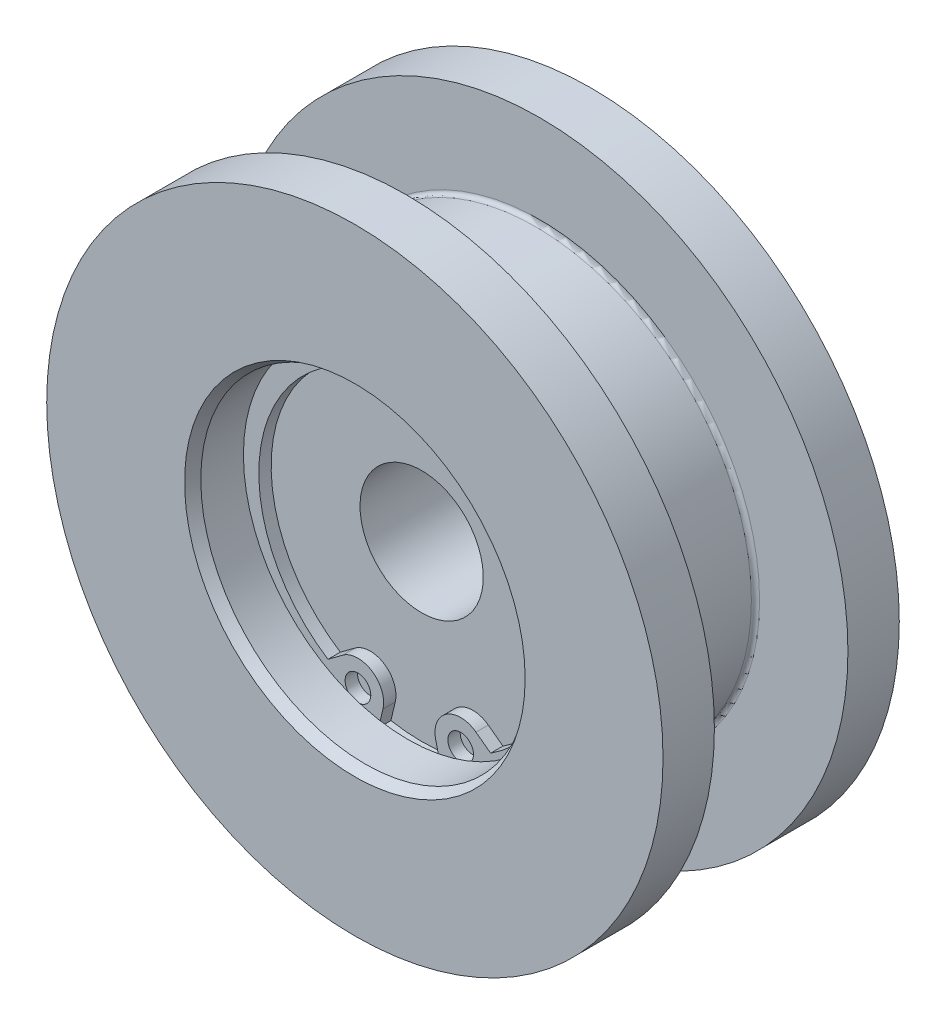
ISO-10303-21;
HEADER;
FILE_DESCRIPTION(('STEP AP214'),'2;1');
FILE_NAME('part.step','',(''),(''),'','','');
FILE_SCHEMA(('AUTOMOTIVE_DESIGN { 1 0 10303 214 1 1 1 1 }'));
ENDSEC;
DATA;
#1=APPLICATION_CONTEXT('core data for automotive mechanical design processes');
#2=APPLICATION_PROTOCOL_DEFINITION('international standard','automotive_design',2000,#1);
#3=PRODUCT_CONTEXT('',#1,'mechanical');
#4=PRODUCT('Part','Part','',(#3));
#5=PRODUCT_RELATED_PRODUCT_CATEGORY('part','',(#4));
#6=PRODUCT_DEFINITION_FORMATION('','',#4);
#7=PRODUCT_DEFINITION_CONTEXT('part definition',#1,'design');
#8=PRODUCT_DEFINITION('design','',#6,#7);
#9=PRODUCT_DEFINITION_SHAPE('','',#8);
#10=(LENGTH_UNIT() NAMED_UNIT(*) SI_UNIT(.MILLI.,.METRE.));
#11=(NAMED_UNIT(*) PLANE_ANGLE_UNIT() SI_UNIT($,.RADIAN.));
#12=(NAMED_UNIT(*) SI_UNIT($,.STERADIAN.) SOLID_ANGLE_UNIT());
#13=UNCERTAINTY_MEASURE_WITH_UNIT(LENGTH_MEASURE(1.E-05),#10,'distance_accuracy_value','');
#14=(GEOMETRIC_REPRESENTATION_CONTEXT(3) GLOBAL_UNCERTAINTY_ASSIGNED_CONTEXT((#13)) GLOBAL_UNIT_ASSIGNED_CONTEXT((#10,
#11,#12)) REPRESENTATION_CONTEXT('',''));
#15=CARTESIAN_POINT('',(0.,0.,0.));
#16=DIRECTION('',(0.,0.,1.));
#17=DIRECTION('',(1.,0.,0.));
#18=AXIS2_PLACEMENT_3D('',#15,#16,#17);
#19=CARTESIAN_POINT('',(17.0522,-17.110876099,5.));
#20=DIRECTION('',(0.,0.,-1.));
#21=DIRECTION('',(-1.,0.,0.));
#22=AXIS2_PLACEMENT_3D('',#19,#20,#21);
#23=PLANE('',#22);
#24=CARTESIAN_POINT('',(5.,-14.2233767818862,5.));
#25=DIRECTION('',(0.,0.,1.));
#26=DIRECTION('',(1.,0.,0.));
#27=AXIS2_PLACEMENT_3D('',#24,#25,#26);
#28=CIRCLE('',#27,1.25);
#29=CARTESIAN_POINT('',(6.25,-14.2233767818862,5.));
#30=VERTEX_POINT('',#29);
#31=EDGE_CURVE('E117',#30,#30,#28,.T.);
#32=ORIENTED_EDGE('',*,*,#31,.T.);
#33=EDGE_LOOP('',(#32));
#34=FACE_BOUND('',#33,.T.);
#35=ADVANCED_FACE('F14',(#34),#23,.F.);
#36=CARTESIAN_POINT('',(-5.,-14.2233767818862,5.));
#37=DIRECTION('',(0.,0.,-1.));
#38=DIRECTION('',(1.,0.,0.));
#39=AXIS2_PLACEMENT_3D('',#36,#37,#38);
#40=CIRCLE('',#39,1.25);
#41=CARTESIAN_POINT('',(-3.75,-14.2233767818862,5.));
#42=VERTEX_POINT('',#41);
#43=EDGE_CURVE('E143',#42,#42,#40,.T.);
#44=ORIENTED_EDGE('',*,*,#43,.F.);
#45=EDGE_LOOP('',(#44));
#46=FACE_BOUND('',#45,.T.);
#47=ADVANCED_FACE('F251',(#46),#23,.F.);
#48=CARTESIAN_POINT('',(0.,0.,-6.1));
#49=DIRECTION('',(0.,0.,1.));
#50=DIRECTION('',(1.,0.,0.));
#51=AXIS2_PLACEMENT_3D('',#48,#49,#50);
#52=CYLINDRICAL_SURFACE('',#51,21.);
#53=CARTESIAN_POINT('',(0.,0.,6.1));
#54=DIRECTION('',(0.,0.,-1.));
#55=DIRECTION('',(-1.,0.,0.));
#56=AXIS2_PLACEMENT_3D('',#53,#54,#55);
#57=CIRCLE('',#56,21.);
#58=CARTESIAN_POINT('',(-21.,0.,6.1));
#59=VERTEX_POINT('',#58);
#60=EDGE_CURVE('E183',#59,#59,#57,.T.);
#61=ORIENTED_EDGE('',*,*,#60,.T.);
#62=EDGE_LOOP('',(#61));
#63=FACE_BOUND('',#62,.T.);
#64=CARTESIAN_POINT('',(0.,0.,-6.1));
#65=DIRECTION('',(0.,0.,1.));
#66=DIRECTION('',(1.,0.,0.));
#67=AXIS2_PLACEMENT_3D('',#64,#65,#66);
#68=CIRCLE('',#67,21.);
#69=CARTESIAN_POINT('',(21.,0.,-6.1));
#70=VERTEX_POINT('',#69);
#71=EDGE_CURVE('E187',#70,#70,#68,.T.);
#72=ORIENTED_EDGE('',*,*,#71,.T.);
#73=EDGE_LOOP('',(#72));
#74=FACE_BOUND('',#73,.T.);
#75=ADVANCED_FACE('F259',(#63,#74),#52,.T.);
#76=CARTESIAN_POINT('',(0.,0.,6.1));
#77=DIRECTION('',(0.,0.,1.));
#78=DIRECTION('',(1.,0.,0.));
#79=AXIS2_PLACEMENT_3D('',#76,#77,#78);
#80=TOROIDAL_SURFACE('',#79,21.4,0.4);
#81=CARTESIAN_POINT('',(0.,0.,6.5));
#82=DIRECTION('',(0.,0.,1.));
#83=DIRECTION('',(1.,0.,0.));
#84=AXIS2_PLACEMENT_3D('',#81,#82,#83);
#85=CIRCLE('',#84,21.40000002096);
#86=CARTESIAN_POINT('',(21.40000002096,0.,6.5));
#87=VERTEX_POINT('',#86);
#88=EDGE_CURVE('E182',#87,#87,#85,.F.);
#89=ORIENTED_EDGE('',*,*,#88,.T.);
#90=EDGE_LOOP('',(#89));
#91=FACE_BOUND('',#90,.T.);
#92=ORIENTED_EDGE('',*,*,#60,.F.);
#93=EDGE_LOOP('',(#92));
#94=FACE_BOUND('',#93,.T.);
#95=ADVANCED_FACE('F299',(#91,#94),#80,.F.);
#96=CARTESIAN_POINT('',(0.,0.,-6.1));
#97=DIRECTION('',(0.,0.,1.));
#98=DIRECTION('',(1.,0.,0.));
#99=AXIS2_PLACEMENT_3D('',#96,#97,#98);
#100=TOROIDAL_SURFACE('',#99,21.4,0.4);
#101=ORIENTED_EDGE('',*,*,#71,.F.);
#102=EDGE_LOOP('',(#101));
#103=FACE_BOUND('',#102,.T.);
#104=CARTESIAN_POINT('',(0.,0.,-6.5));
#105=DIRECTION('',(0.,0.,1.));
#106=DIRECTION('',(1.,0.,0.));
#107=AXIS2_PLACEMENT_3D('',#104,#105,#106);
#108=CIRCLE('',#107,21.4);
#109=CARTESIAN_POINT('',(21.4,0.,-6.5));
#110=VERTEX_POINT('',#109);
#111=EDGE_CURVE('E205',#110,#110,#108,.F.);
#112=ORIENTED_EDGE('',*,*,#111,.F.);
#113=EDGE_LOOP('',(#112));
#114=FACE_BOUND('',#113,.T.);
#115=ADVANCED_FACE('F318',(#103,#114),#100,.F.);
#116=CARTESIAN_POINT('',(-30.36,-30.464467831,6.5));
#117=DIRECTION('',(0.,0.,1.));
#118=DIRECTION('',(1.,0.,0.));
#119=AXIS2_PLACEMENT_3D('',#116,#117,#118);
#120=PLANE('',#119);
#121=ORIENTED_EDGE('',*,*,#88,.F.);
#122=EDGE_LOOP('',(#121));
#123=FACE_BOUND('',#122,.T.);
#124=CARTESIAN_POINT('',(0.,0.,6.5));
#125=DIRECTION('',(0.,0.,1.));
#126=DIRECTION('',(1.,0.,0.));
#127=AXIS2_PLACEMENT_3D('',#124,#125,#126);
#128=CIRCLE('',#127,30.);
#129=CARTESIAN_POINT('',(30.,0.,6.5));
#130=VERTEX_POINT('',#129);
#131=EDGE_CURVE('E193',#130,#130,#128,.T.);
#132=ORIENTED_EDGE('',*,*,#131,.F.);
#133=EDGE_LOOP('',(#132));
#134=FACE_BOUND('',#133,.T.);
#135=ADVANCED_FACE('F311',(#123,#134),#120,.F.);
#136=CARTESIAN_POINT('',(30.36,-30.464467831,-6.5));
#137=DIRECTION('',(0.,0.,-1.));
#138=DIRECTION('',(-1.,0.,0.));
#139=AXIS2_PLACEMENT_3D('',#136,#137,#138);
#140=PLANE('',#139);
#141=ORIENTED_EDGE('',*,*,#111,.T.);
#142=EDGE_LOOP('',(#141));
#143=FACE_BOUND('',#142,.T.);
#144=CARTESIAN_POINT('',(0.,0.,-6.5));
#145=DIRECTION('',(0.,0.,1.));
#146=DIRECTION('',(1.,0.,0.));
#147=AXIS2_PLACEMENT_3D('',#144,#145,#146);
#148=CIRCLE('',#147,30.);
#149=CARTESIAN_POINT('',(30.,0.,-6.5));
#150=VERTEX_POINT('',#149);
#151=EDGE_CURVE('E211',#150,#150,#148,.F.);
#152=ORIENTED_EDGE('',*,*,#151,.F.);
#153=EDGE_LOOP('',(#152));
#154=FACE_BOUND('',#153,.T.);
#155=ADVANCED_FACE('F306',(#143,#154),#140,.F.);
#156=CARTESIAN_POINT('',(0.,0.,6.5));
#157=DIRECTION('',(0.,0.,1.));
#158=DIRECTION('',(1.,0.,0.));
#159=AXIS2_PLACEMENT_3D('',#156,#157,#158);
#160=CYLINDRICAL_SURFACE('',#159,30.);
#161=CARTESIAN_POINT('',(0.,0.,11.5));
#162=DIRECTION('',(0.,0.,1.));
#163=DIRECTION('',(1.,0.,0.));
#164=AXIS2_PLACEMENT_3D('',#161,#162,#163);
#165=CIRCLE('',#164,30.);
#166=CARTESIAN_POINT('',(30.,0.,11.5));
#167=VERTEX_POINT('',#166);
#168=EDGE_CURVE('E144',#167,#167,#165,.F.);
#169=ORIENTED_EDGE('',*,*,#168,.T.);
#170=EDGE_LOOP('',(#169));
#171=FACE_BOUND('',#170,.T.);
#172=ORIENTED_EDGE('',*,*,#131,.T.);
#173=EDGE_LOOP('',(#172));
#174=FACE_BOUND('',#173,.T.);
#175=ADVANCED_FACE('F293',(#171,#174),#160,.T.);
#176=CARTESIAN_POINT('',(0.,0.,-11.5));
#177=DIRECTION('',(0.,0.,1.));
#178=DIRECTION('',(1.,0.,0.));
#179=AXIS2_PLACEMENT_3D('',#176,#177,#178);
#180=CYLINDRICAL_SURFACE('',#179,30.);
#181=ORIENTED_EDGE('',*,*,#151,.T.);
#182=EDGE_LOOP('',(#181));
#183=FACE_BOUND('',#182,.T.);
#184=CARTESIAN_POINT('',(0.,0.,-11.5));
#185=DIRECTION('',(0.,0.,1.));
#186=DIRECTION('',(1.,0.,0.));
#187=AXIS2_PLACEMENT_3D('',#184,#185,#186);
#188=CIRCLE('',#187,30.);
#189=CARTESIAN_POINT('',(30.,0.,-11.5));
#190=VERTEX_POINT('',#189);
#191=EDGE_CURVE('E217',#190,#190,#188,.T.);
#192=ORIENTED_EDGE('',*,*,#191,.T.);
#193=EDGE_LOOP('',(#192));
#194=FACE_BOUND('',#193,.T.);
#195=ADVANCED_FACE('F290',(#183,#194),#180,.T.);
#196=CARTESIAN_POINT('',(30.36,-30.464467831,11.5));
#197=DIRECTION('',(0.,0.,-1.));
#198=DIRECTION('',(-1.,0.,0.));
#199=AXIS2_PLACEMENT_3D('',#196,#197,#198);
#200=PLANE('',#199);
#201=CARTESIAN_POINT('',(0.,0.,11.5));
#202=DIRECTION('',(0.,0.,1.));
#203=DIRECTION('',(1.,0.,0.));
#204=AXIS2_PLACEMENT_3D('',#201,#202,#203);
#205=CIRCLE('',#204,16.577350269);
#206=CARTESIAN_POINT('',(16.577350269,0.,11.5));
#207=VERTEX_POINT('',#206);
#208=EDGE_CURVE('E196',#207,#207,#205,.T.);
#209=ORIENTED_EDGE('',*,*,#208,.F.);
#210=EDGE_LOOP('',(#209));
#211=FACE_BOUND('',#210,.T.);
#212=ORIENTED_EDGE('',*,*,#168,.F.);
#213=EDGE_LOOP('',(#212));
#214=FACE_BOUND('',#213,.T.);
#215=ADVANCED_FACE('F16',(#211,#214),#200,.F.);
#216=CARTESIAN_POINT('',(-30.36,-30.464467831,-11.5));
#217=DIRECTION('',(0.,0.,1.));
#218=DIRECTION('',(1.,0.,0.));
#219=AXIS2_PLACEMENT_3D('',#216,#217,#218);
#220=PLANE('',#219);
#221=CARTESIAN_POINT('',(0.,0.,-11.5));
#222=DIRECTION('',(0.,0.,1.));
#223=DIRECTION('',(1.,0.,0.));
#224=AXIS2_PLACEMENT_3D('',#221,#222,#223);
#225=CIRCLE('',#224,13.);
#226=CARTESIAN_POINT('',(13.,0.,-11.5));
#227=VERTEX_POINT('',#226);
#228=EDGE_CURVE('E223',#227,#227,#225,.F.);
#229=ORIENTED_EDGE('',*,*,#228,.F.);
#230=EDGE_LOOP('',(#229));
#231=FACE_BOUND('',#230,.T.);
#232=ORIENTED_EDGE('',*,*,#191,.F.);
#233=EDGE_LOOP('',(#232));
#234=FACE_BOUND('',#233,.T.);
#235=ADVANCED_FACE('F303',(#231,#234),#220,.F.);
#236=CARTESIAN_POINT('',(0.,0.,10.5));
#237=DIRECTION('',(0.,0.,1.));
#238=DIRECTION('',(1.,0.,0.));
#239=AXIS2_PLACEMENT_3D('',#236,#237,#238);
#240=CONICAL_SURFACE('',#239,16.,0.523598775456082);
#241=CARTESIAN_POINT('',(0.,0.,10.5));
#242=DIRECTION('',(0.,0.,1.));
#243=DIRECTION('',(1.,0.,0.));
#244=AXIS2_PLACEMENT_3D('',#241,#242,#243);
#245=CIRCLE('',#244,16.);
#246=CARTESIAN_POINT('',(16.,0.,10.5));
#247=VERTEX_POINT('',#246);
#248=EDGE_CURVE('E179',#247,#247,#245,.T.);
#249=ORIENTED_EDGE('',*,*,#248,.F.);
#250=EDGE_LOOP('',(#249));
#251=FACE_BOUND('',#250,.T.);
#252=ORIENTED_EDGE('',*,*,#208,.T.);
#253=EDGE_LOOP('',(#252));
#254=FACE_BOUND('',#253,.T.);
#255=ADVANCED_FACE('F285',(#251,#254),#240,.F.);
#256=CARTESIAN_POINT('',(0.,0.,-11.5));
#257=DIRECTION('',(0.,0.,1.));
#258=DIRECTION('',(1.,0.,0.));
#259=AXIS2_PLACEMENT_3D('',#256,#257,#258);
#260=CYLINDRICAL_SURFACE('',#259,13.);
#261=ORIENTED_EDGE('',*,*,#228,.T.);
#262=EDGE_LOOP('',(#261));
#263=FACE_BOUND('',#262,.T.);
#264=CARTESIAN_POINT('',(0.,0.,-5.));
#265=DIRECTION('',(0.,0.,1.));
#266=DIRECTION('',(1.,0.,0.));
#267=AXIS2_PLACEMENT_3D('',#264,#265,#266);
#268=CIRCLE('',#267,13.);
#269=CARTESIAN_POINT('',(13.,0.,-5.));
#270=VERTEX_POINT('',#269);
#271=EDGE_CURVE('E226',#270,#270,#268,.T.);
#272=ORIENTED_EDGE('',*,*,#271,.T.);
#273=EDGE_LOOP('',(#272));
#274=FACE_BOUND('',#273,.T.);
#275=ADVANCED_FACE('F230',(#263,#274),#260,.F.);
#276=CARTESIAN_POINT('',(0.,0.,6.35));
#277=DIRECTION('',(0.,0.,1.));
#278=DIRECTION('',(1.,0.,0.));
#279=AXIS2_PLACEMENT_3D('',#276,#277,#278);
#280=CYLINDRICAL_SURFACE('',#279,16.);
#281=CARTESIAN_POINT('',(0.,0.,6.35));
#282=DIRECTION('',(0.,0.,1.));
#283=DIRECTION('',(1.,0.,0.));
#284=AXIS2_PLACEMENT_3D('',#281,#282,#283);
#285=CIRCLE('',#284,16.);
#286=CARTESIAN_POINT('',(16.,0.,6.35));
#287=VERTEX_POINT('',#286);
#288=EDGE_CURVE('E186',#287,#287,#285,.T.);
#289=ORIENTED_EDGE('',*,*,#288,.F.);
#290=EDGE_LOOP('',(#289));
#291=FACE_BOUND('',#290,.T.);
#292=ORIENTED_EDGE('',*,*,#248,.T.);
#293=EDGE_LOOP('',(#292));
#294=FACE_BOUND('',#293,.T.);
#295=ADVANCED_FACE('F235',(#291,#294),#280,.F.);
#296=CARTESIAN_POINT('',(-13.156,-13.201269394,-5.));
#297=DIRECTION('',(0.,0.,1.));
#298=DIRECTION('',(1.,0.,0.));
#299=AXIS2_PLACEMENT_3D('',#296,#297,#298);
#300=PLANE('',#299);
#301=CARTESIAN_POINT('',(0.,0.,-5.));
#302=DIRECTION('',(0.,0.,1.));
#303=DIRECTION('',(0.,-1.,0.));
#304=AXIS2_PLACEMENT_3D('',#301,#302,#303);
#305=CIRCLE('',#304,6.);
#306=CARTESIAN_POINT('',(0.,-6.,-5.));
#307=VERTEX_POINT('',#306);
#308=EDGE_CURVE('E220',#307,#307,#305,.T.);
#309=ORIENTED_EDGE('',*,*,#308,.T.);
#310=EDGE_LOOP('',(#309));
#311=FACE_BOUND('',#310,.T.);
#312=ORIENTED_EDGE('',*,*,#271,.F.);
#313=EDGE_LOOP('',(#312));
#314=FACE_BOUND('',#313,.T.);
#315=ADVANCED_FACE('F232',(#311,#314),#300,.F.);
#316=CARTESIAN_POINT('',(-17.0522,-17.110876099,6.35));
#317=DIRECTION('',(0.,0.,1.));
#318=DIRECTION('',(1.,0.,0.));
#319=AXIS2_PLACEMENT_3D('',#316,#317,#318);
#320=PLANE('',#319);
#321=ORIENTED_EDGE('',*,*,#288,.T.);
#322=EDGE_LOOP('',(#321));
#323=FACE_BOUND('',#322,.T.);
#324=CARTESIAN_POINT('',(0.,0.,6.35));
#325=DIRECTION('',(0.,0.,1.));
#326=DIRECTION('',(1.,0.,0.));
#327=AXIS2_PLACEMENT_3D('',#324,#325,#326);
#328=CIRCLE('',#327,16.85);
#329=CARTESIAN_POINT('',(16.85,0.,6.35));
#330=VERTEX_POINT('',#329);
#331=EDGE_CURVE('E190',#330,#330,#328,.T.);
#332=ORIENTED_EDGE('',*,*,#331,.F.);
#333=EDGE_LOOP('',(#332));
#334=FACE_BOUND('',#333,.T.);
#335=ADVANCED_FACE('F234',(#323,#334),#320,.F.);
#336=CARTESIAN_POINT('',(0.,0.,5.));
#337=DIRECTION('',(0.,0.,1.));
#338=DIRECTION('',(1.,0.,0.));
#339=AXIS2_PLACEMENT_3D('',#336,#337,#338);
#340=CYLINDRICAL_SURFACE('',#339,16.85);
#341=ORIENTED_EDGE('',*,*,#331,.T.);
#342=EDGE_LOOP('',(#341));
#343=FACE_BOUND('',#342,.T.);
#344=DIRECTION('',(0.,0.,1.));
#345=VECTOR('',#344,1.);
#346=CARTESIAN_POINT('',(2.99125499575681,-16.5823669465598,5.));
#347=LINE('',#346,#345);
#348=CARTESIAN_POINT('',(2.99125499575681,-16.5823669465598,5.));
#349=VERTEX_POINT('',#348);
#350=CARTESIAN_POINT('',(2.99125499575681,-16.5823669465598,6.2));
#351=VERTEX_POINT('',#350);
#352=EDGE_CURVE('E18',#349,#351,#347,.T.);
#353=ORIENTED_EDGE('',*,*,#352,.F.);
#354=CARTESIAN_POINT('',(0.,0.,5.));
#355=DIRECTION('',(0.,0.,1.));
#356=DIRECTION('',(1.,0.,0.));
#357=AXIS2_PLACEMENT_3D('',#354,#355,#356);
#358=CIRCLE('',#357,16.85);
#359=CARTESIAN_POINT('',(-2.99125499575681,-16.5823669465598,5.));
#360=VERTEX_POINT('',#359);
#361=EDGE_CURVE('E208',#360,#349,#358,.T.);
#362=ORIENTED_EDGE('',*,*,#361,.F.);
#363=DIRECTION('',(0.,0.,1.));
#364=VECTOR('',#363,1.);
#365=CARTESIAN_POINT('',(-2.99125499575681,-16.5823669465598,5.));
#366=LINE('',#365,#364);
#367=CARTESIAN_POINT('',(-2.99125499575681,-16.5823669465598,6.2));
#368=VERTEX_POINT('',#367);
#369=EDGE_CURVE('E176',#368,#360,#366,.F.);
#370=ORIENTED_EDGE('',*,*,#369,.F.);
#371=CARTESIAN_POINT('',(0.,0.,6.2));
#372=DIRECTION('',(0.,0.,-1.));
#373=DIRECTION('',(-1.,0.,0.));
#374=AXIS2_PLACEMENT_3D('',#371,#372,#373);
#375=CIRCLE('',#374,16.85);
#376=EDGE_CURVE('E9',#351,#368,#375,.F.);
#377=ORIENTED_EDGE('',*,*,#376,.F.);
#378=EDGE_LOOP('',(#353,#362,#370,#377));
#379=FACE_BOUND('',#378,.T.);
#380=ADVANCED_FACE('F243',(#343,#379),#340,.F.);
#381=CARTESIAN_POINT('',(0.,0.,-5.));
#382=DIRECTION('',(0.,0.,1.));
#383=DIRECTION('',(0.,-1.,0.));
#384=AXIS2_PLACEMENT_3D('',#381,#382,#383);
#385=CYLINDRICAL_SURFACE('',#384,6.);
#386=ORIENTED_EDGE('',*,*,#308,.F.);
#387=EDGE_LOOP('',(#386));
#388=FACE_BOUND('',#387,.T.);
#389=CARTESIAN_POINT('',(0.,0.,5.));
#390=DIRECTION('',(0.,0.,1.));
#391=DIRECTION('',(0.,-1.,0.));
#392=AXIS2_PLACEMENT_3D('',#389,#390,#391);
#393=CIRCLE('',#392,6.);
#394=CARTESIAN_POINT('',(0.,-6.,5.));
#395=VERTEX_POINT('',#394);
#396=EDGE_CURVE('E214',#395,#395,#393,.T.);
#397=ORIENTED_EDGE('',*,*,#396,.T.);
#398=EDGE_LOOP('',(#397));
#399=FACE_BOUND('',#398,.T.);
#400=ADVANCED_FACE('F264',(#388,#399),#385,.F.);
#401=ORIENTED_EDGE('',*,*,#396,.F.);
#402=EDGE_LOOP('',(#401));
#403=FACE_BOUND('',#402,.T.);
#404=ORIENTED_EDGE('',*,*,#361,.T.);
#405=DIRECTION('',(0.231349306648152,-0.972870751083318,0.));
#406=VECTOR('',#405,1.);
#407=CARTESIAN_POINT('',(2.5678231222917,-14.8017500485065,5.));
#408=LINE('',#407,#406);
#409=CARTESIAN_POINT('',(2.5678231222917,-14.8017500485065,5.));
#410=VERTEX_POINT('',#409);
#411=EDGE_CURVE('E34',#410,#349,#408,.T.);
#412=ORIENTED_EDGE('',*,*,#411,.F.);
#413=CARTESIAN_POINT('',(5.,-14.2233767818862,5.));
#414=DIRECTION('',(0.,0.,1.));
#415=DIRECTION('',(1.,0.,0.));
#416=AXIS2_PLACEMENT_3D('',#413,#414,#415);
#417=CIRCLE('',#416,2.5);
#418=CARTESIAN_POINT('',(6.49138441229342,-12.2169439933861,5.));
#419=VERTEX_POINT('',#418);
#420=EDGE_CURVE('E134',#419,#410,#417,.T.);
#421=ORIENTED_EDGE('',*,*,#420,.F.);
#422=DIRECTION('',(-0.802573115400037,0.596553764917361,0.));
#423=VECTOR('',#422,1.);
#424=CARTESIAN_POINT('',(6.49138441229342,-12.2169439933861,5.));
#425=LINE('',#424,#423);
#426=CARTESIAN_POINT('',(7.91695293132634,-13.2765711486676,5.));
#427=VERTEX_POINT('',#426);
#428=EDGE_CURVE('E148',#427,#419,#425,.T.);
#429=ORIENTED_EDGE('',*,*,#428,.F.);
#430=CARTESIAN_POINT('',(0.,-0.95,5.));
#431=DIRECTION('',(0.,0.,-1.));
#432=DIRECTION('',(0.,-1.,0.));
#433=AXIS2_PLACEMENT_3D('',#430,#431,#432);
#434=CIRCLE('',#433,14.65);
#435=CARTESIAN_POINT('',(-7.91695293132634,-13.2765711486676,5.));
#436=VERTEX_POINT('',#435);
#437=EDGE_CURVE('E163',#436,#427,#434,.T.);
#438=ORIENTED_EDGE('',*,*,#437,.F.);
#439=DIRECTION('',(-0.802573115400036,-0.596553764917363,0.));
#440=VECTOR('',#439,1.);
#441=CARTESIAN_POINT('',(-6.49138441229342,-12.2169439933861,5.));
#442=LINE('',#441,#440);
#443=CARTESIAN_POINT('',(-6.49138441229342,-12.2169439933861,5.));
#444=VERTEX_POINT('',#443);
#445=EDGE_CURVE('E116',#444,#436,#442,.T.);
#446=ORIENTED_EDGE('',*,*,#445,.F.);
#447=CARTESIAN_POINT('',(-5.,-14.2233767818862,5.));
#448=DIRECTION('',(0.,0.,1.));
#449=DIRECTION('',(-1.,0.,0.));
#450=AXIS2_PLACEMENT_3D('',#447,#448,#449);
#451=CIRCLE('',#450,2.5);
#452=CARTESIAN_POINT('',(-2.56782312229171,-14.8017500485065,5.));
#453=VERTEX_POINT('',#452);
#454=EDGE_CURVE('E113',#453,#444,#451,.T.);
#455=ORIENTED_EDGE('',*,*,#454,.F.);
#456=DIRECTION('',(0.231349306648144,0.97287075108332,0.));
#457=VECTOR('',#456,1.);
#458=CARTESIAN_POINT('',(-2.56782312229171,-14.8017500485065,5.));
#459=LINE('',#458,#457);
#460=EDGE_CURVE('E155',#360,#453,#459,.T.);
#461=ORIENTED_EDGE('',*,*,#460,.F.);
#462=EDGE_LOOP('',(#404,#412,#421,#429,#438,#446,#455,#461));
#463=FACE_BOUND('',#462,.T.);
#464=ADVANCED_FACE('F254',(#403,#463),#23,.F.);
#465=CARTESIAN_POINT('',(0.,-0.95,6.2));
#466=DIRECTION('',(0.,0.,1.));
#467=DIRECTION('',(-1.,0.,0.));
#468=AXIS2_PLACEMENT_3D('',#465,#466,#467);
#469=CYLINDRICAL_SURFACE('',#468,14.65);
#470=ORIENTED_EDGE('',*,*,#437,.T.);
#471=DIRECTION('',(0.,0.,-1.));
#472=VECTOR('',#471,1.);
#473=CARTESIAN_POINT('',(7.91695293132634,-13.2765711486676,6.2));
#474=LINE('',#473,#472);
#475=CARTESIAN_POINT('',(7.91695293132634,-13.2765711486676,6.2));
#476=VERTEX_POINT('',#475);
#477=EDGE_CURVE('E103',#476,#427,#474,.T.);
#478=ORIENTED_EDGE('',*,*,#477,.F.);
#479=CARTESIAN_POINT('',(0.,-0.95,6.2));
#480=DIRECTION('',(0.,0.,-1.));
#481=DIRECTION('',(0.,-1.,0.));
#482=AXIS2_PLACEMENT_3D('',#479,#480,#481);
#483=CIRCLE('',#482,14.65);
#484=CARTESIAN_POINT('',(-7.91695293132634,-13.2765711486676,6.2));
#485=VERTEX_POINT('',#484);
#486=EDGE_CURVE('E104',#485,#476,#483,.T.);
#487=ORIENTED_EDGE('',*,*,#486,.F.);
#488=DIRECTION('',(0.,0.,-1.));
#489=VECTOR('',#488,1.);
#490=CARTESIAN_POINT('',(-7.91695293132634,-13.2765711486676,6.2));
#491=LINE('',#490,#489);
#492=EDGE_CURVE('E98',#485,#436,#491,.T.);
#493=ORIENTED_EDGE('',*,*,#492,.T.);
#494=EDGE_LOOP('',(#470,#478,#487,#493));
#495=FACE_BOUND('',#494,.T.);
#496=ADVANCED_FACE('F255',(#495),#469,.F.);
#497=CARTESIAN_POINT('',(6.49138441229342,-12.2169439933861,6.2));
#498=DIRECTION('',(-0.596553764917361,-0.802573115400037,0.));
#499=DIRECTION('',(-0.802573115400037,0.596553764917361,0.));
#500=AXIS2_PLACEMENT_3D('',#497,#498,#499);
#501=PLANE('',#500);
#502=ORIENTED_EDGE('',*,*,#428,.T.);
#503=DIRECTION('',(0.,0.,-1.));
#504=VECTOR('',#503,1.);
#505=CARTESIAN_POINT('',(6.49138441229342,-12.2169439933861,6.2));
#506=LINE('',#505,#504);
#507=CARTESIAN_POINT('',(6.49138441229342,-12.2169439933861,6.2));
#508=VERTEX_POINT('',#507);
#509=EDGE_CURVE('E153',#508,#419,#506,.T.);
#510=ORIENTED_EDGE('',*,*,#509,.F.);
#511=DIRECTION('',(-0.802573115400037,0.596553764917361,0.));
#512=VECTOR('',#511,1.);
#513=CARTESIAN_POINT('',(6.49138441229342,-12.2169439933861,6.2));
#514=LINE('',#513,#512);
#515=EDGE_CURVE('E138',#476,#508,#514,.T.);
#516=ORIENTED_EDGE('',*,*,#515,.F.);
#517=ORIENTED_EDGE('',*,*,#477,.T.);
#518=EDGE_LOOP('',(#502,#510,#516,#517));
#519=FACE_BOUND('',#518,.T.);
#520=ADVANCED_FACE('F267',(#519),#501,.F.);
#521=CARTESIAN_POINT('',(5.,-14.2233767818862,6.2));
#522=DIRECTION('',(0.,0.,1.));
#523=DIRECTION('',(-1.,0.,0.));
#524=AXIS2_PLACEMENT_3D('',#521,#522,#523);
#525=CYLINDRICAL_SURFACE('',#524,2.5);
#526=ORIENTED_EDGE('',*,*,#420,.T.);
#527=DIRECTION('',(0.,0.,-1.));
#528=VECTOR('',#527,1.);
#529=CARTESIAN_POINT('',(2.5678231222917,-14.8017500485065,6.2));
#530=LINE('',#529,#528);
#531=CARTESIAN_POINT('',(2.5678231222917,-14.8017500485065,6.2));
#532=VERTEX_POINT('',#531);
#533=EDGE_CURVE('E154',#532,#410,#530,.T.);
#534=ORIENTED_EDGE('',*,*,#533,.F.);
#535=CARTESIAN_POINT('',(5.,-14.2233767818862,6.2));
#536=DIRECTION('',(0.,0.,1.));
#537=DIRECTION('',(1.,0.,0.));
#538=AXIS2_PLACEMENT_3D('',#535,#536,#537);
#539=CIRCLE('',#538,2.5);
#540=EDGE_CURVE('E167',#508,#532,#539,.T.);
#541=ORIENTED_EDGE('',*,*,#540,.F.);
#542=ORIENTED_EDGE('',*,*,#509,.T.);
#543=EDGE_LOOP('',(#526,#534,#541,#542));
#544=FACE_BOUND('',#543,.T.);
#545=ADVANCED_FACE('F273',(#544),#525,.T.);
#546=CARTESIAN_POINT('',(-2.56782312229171,-14.8017500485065,6.2));
#547=DIRECTION('',(-0.97287075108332,0.231349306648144,0.));
#548=DIRECTION('',(0.,0.,1.));
#549=AXIS2_PLACEMENT_3D('',#546,#547,#548);
#550=PLANE('',#549);
#551=DIRECTION('',(0.231349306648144,0.97287075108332,0.));
#552=VECTOR('',#551,1.);
#553=CARTESIAN_POINT('',(-2.56782312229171,-14.8017500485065,6.2));
#554=LINE('',#553,#552);
#555=CARTESIAN_POINT('',(-2.56782312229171,-14.8017500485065,6.2));
#556=VERTEX_POINT('',#555);
#557=EDGE_CURVE('E122',#368,#556,#554,.T.);
#558=ORIENTED_EDGE('',*,*,#557,.F.);
#559=ORIENTED_EDGE('',*,*,#369,.T.);
#560=ORIENTED_EDGE('',*,*,#460,.T.);
#561=DIRECTION('',(0.,0.,-1.));
#562=VECTOR('',#561,1.);
#563=CARTESIAN_POINT('',(-2.56782312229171,-14.8017500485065,6.2));
#564=LINE('',#563,#562);
#565=EDGE_CURVE('E172',#556,#453,#564,.T.);
#566=ORIENTED_EDGE('',*,*,#565,.F.);
#567=EDGE_LOOP('',(#558,#559,#560,#566));
#568=FACE_BOUND('',#567,.T.);
#569=ADVANCED_FACE('F281',(#568),#550,.F.);
#570=CARTESIAN_POINT('',(0.,-0.95,6.2));
#571=DIRECTION('',(0.,0.,-1.));
#572=DIRECTION('',(0.,-1.,0.));
#573=AXIS2_PLACEMENT_3D('',#570,#571,#572);
#574=PLANE('',#573);
#575=CARTESIAN_POINT('',(-5.,-14.2233767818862,6.2));
#576=DIRECTION('',(0.,0.,-1.));
#577=DIRECTION('',(1.,0.,0.));
#578=AXIS2_PLACEMENT_3D('',#575,#576,#577);
#579=CIRCLE('',#578,1.25);
#580=CARTESIAN_POINT('',(-3.75,-14.2233767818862,6.2));
#581=VERTEX_POINT('',#580);
#582=EDGE_CURVE('E124',#581,#581,#579,.T.);
#583=ORIENTED_EDGE('',*,*,#582,.T.);
#584=EDGE_LOOP('',(#583));
#585=FACE_BOUND('',#584,.T.);
#586=CARTESIAN_POINT('',(5.,-14.2233767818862,6.2));
#587=DIRECTION('',(0.,0.,1.));
#588=DIRECTION('',(1.,0.,0.));
#589=AXIS2_PLACEMENT_3D('',#586,#587,#588);
#590=CIRCLE('',#589,1.25);
#591=CARTESIAN_POINT('',(6.25,-14.2233767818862,6.2));
#592=VERTEX_POINT('',#591);
#593=EDGE_CURVE('E140',#592,#592,#590,.T.);
#594=ORIENTED_EDGE('',*,*,#593,.F.);
#595=EDGE_LOOP('',(#594));
#596=FACE_BOUND('',#595,.T.);
#597=DIRECTION('',(0.231349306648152,-0.972870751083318,0.));
#598=VECTOR('',#597,1.);
#599=CARTESIAN_POINT('',(2.5678231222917,-14.8017500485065,6.2));
#600=LINE('',#599,#598);
#601=EDGE_CURVE('E130',#532,#351,#600,.T.);
#602=ORIENTED_EDGE('',*,*,#601,.T.);
#603=ORIENTED_EDGE('',*,*,#376,.T.);
#604=ORIENTED_EDGE('',*,*,#557,.T.);
#605=CARTESIAN_POINT('',(-5.,-14.2233767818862,6.2));
#606=DIRECTION('',(0.,0.,1.));
#607=DIRECTION('',(-1.,0.,0.));
#608=AXIS2_PLACEMENT_3D('',#605,#606,#607);
#609=CIRCLE('',#608,2.5);
#610=CARTESIAN_POINT('',(-6.49138441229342,-12.2169439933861,6.2));
#611=VERTEX_POINT('',#610);
#612=EDGE_CURVE('E110',#556,#611,#609,.T.);
#613=ORIENTED_EDGE('',*,*,#612,.T.);
#614=DIRECTION('',(-0.802573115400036,-0.596553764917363,0.));
#615=VECTOR('',#614,1.);
#616=CARTESIAN_POINT('',(-6.49138441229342,-12.2169439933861,6.2));
#617=LINE('',#616,#615);
#618=EDGE_CURVE('E93',#611,#485,#617,.T.);
#619=ORIENTED_EDGE('',*,*,#618,.T.);
#620=ORIENTED_EDGE('',*,*,#486,.T.);
#621=ORIENTED_EDGE('',*,*,#515,.T.);
#622=ORIENTED_EDGE('',*,*,#540,.T.);
#623=EDGE_LOOP('',(#602,#603,#604,#613,#619,#620,#621,#622));
#624=FACE_BOUND('',#623,.T.);
#625=ADVANCED_FACE('F120',(#585,#596,#624),#574,.F.);
#626=CARTESIAN_POINT('',(5.,-14.2233767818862,6.2));
#627=DIRECTION('',(0.,0.,1.));
#628=DIRECTION('',(-1.,0.,0.));
#629=AXIS2_PLACEMENT_3D('',#626,#627,#628);
#630=CYLINDRICAL_SURFACE('',#629,1.25);
#631=ORIENTED_EDGE('',*,*,#31,.F.);
#632=EDGE_LOOP('',(#631));
#633=FACE_BOUND('',#632,.T.);
#634=ORIENTED_EDGE('',*,*,#593,.T.);
#635=EDGE_LOOP('',(#634));
#636=FACE_BOUND('',#635,.T.);
#637=ADVANCED_FACE('F481',(#633,#636),#630,.F.);
#638=CARTESIAN_POINT('',(-5.,-14.2233767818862,6.2));
#639=DIRECTION('',(0.,0.,1.));
#640=DIRECTION('',(-1.,0.,0.));
#641=AXIS2_PLACEMENT_3D('',#638,#639,#640);
#642=CYLINDRICAL_SURFACE('',#641,1.25);
#643=ORIENTED_EDGE('',*,*,#43,.T.);
#644=EDGE_LOOP('',(#643));
#645=FACE_BOUND('',#644,.T.);
#646=ORIENTED_EDGE('',*,*,#582,.F.);
#647=EDGE_LOOP('',(#646));
#648=FACE_BOUND('',#647,.T.);
#649=ADVANCED_FACE('F492',(#645,#648),#642,.F.);
#650=CARTESIAN_POINT('',(-6.49138441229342,-12.2169439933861,6.2));
#651=DIRECTION('',(0.596553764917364,-0.802573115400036,0.));
#652=DIRECTION('',(0.,0.,-1.));
#653=AXIS2_PLACEMENT_3D('',#650,#651,#652);
#654=PLANE('',#653);
#655=ORIENTED_EDGE('',*,*,#445,.T.);
#656=ORIENTED_EDGE('',*,*,#492,.F.);
#657=ORIENTED_EDGE('',*,*,#618,.F.);
#658=DIRECTION('',(0.,0.,-1.));
#659=VECTOR('',#658,1.);
#660=CARTESIAN_POINT('',(-6.49138441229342,-12.2169439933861,6.2));
#661=LINE('',#660,#659);
#662=EDGE_CURVE('E96',#611,#444,#661,.T.);
#663=ORIENTED_EDGE('',*,*,#662,.T.);
#664=EDGE_LOOP('',(#655,#656,#657,#663));
#665=FACE_BOUND('',#664,.T.);
#666=ADVANCED_FACE('F95',(#665),#654,.F.);
#667=CARTESIAN_POINT('',(-5.,-14.2233767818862,6.2));
#668=DIRECTION('',(0.,0.,1.));
#669=DIRECTION('',(-1.,0.,0.));
#670=AXIS2_PLACEMENT_3D('',#667,#668,#669);
#671=CYLINDRICAL_SURFACE('',#670,2.5);
#672=ORIENTED_EDGE('',*,*,#454,.T.);
#673=ORIENTED_EDGE('',*,*,#662,.F.);
#674=ORIENTED_EDGE('',*,*,#612,.F.);
#675=ORIENTED_EDGE('',*,*,#565,.T.);
#676=EDGE_LOOP('',(#672,#673,#674,#675));
#677=FACE_BOUND('',#676,.T.);
#678=ADVANCED_FACE('F108',(#677),#671,.T.);
#679=CARTESIAN_POINT('',(2.5678231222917,-14.8017500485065,6.2));
#680=DIRECTION('',(0.972870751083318,0.231349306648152,0.));
#681=DIRECTION('',(0.,0.,-1.));
#682=AXIS2_PLACEMENT_3D('',#679,#680,#681);
#683=PLANE('',#682);
#684=ORIENTED_EDGE('',*,*,#411,.T.);
#685=ORIENTED_EDGE('',*,*,#352,.T.);
#686=ORIENTED_EDGE('',*,*,#601,.F.);
#687=ORIENTED_EDGE('',*,*,#533,.T.);
#688=EDGE_LOOP('',(#684,#685,#686,#687));
#689=FACE_BOUND('',#688,.T.);
#690=ADVANCED_FACE('F261',(#689),#683,.F.);
#691=CLOSED_SHELL('',(#35,#47,#75,#95,#115,#135,#155,#175,#195,#215,#235,#255,#275,#295,#315,
#335,#380,#400,#464,#496,#520,#545,#569,#625,#637,#649,#666,#678,#690));
#692=MANIFOLD_SOLID_BREP('B1',#691);
#693=ADVANCED_BREP_SHAPE_REPRESENTATION('',(#18,#692),#14);
#694=SHAPE_DEFINITION_REPRESENTATION(#9,#693);
ENDSEC;
END-ISO-10303-21;
